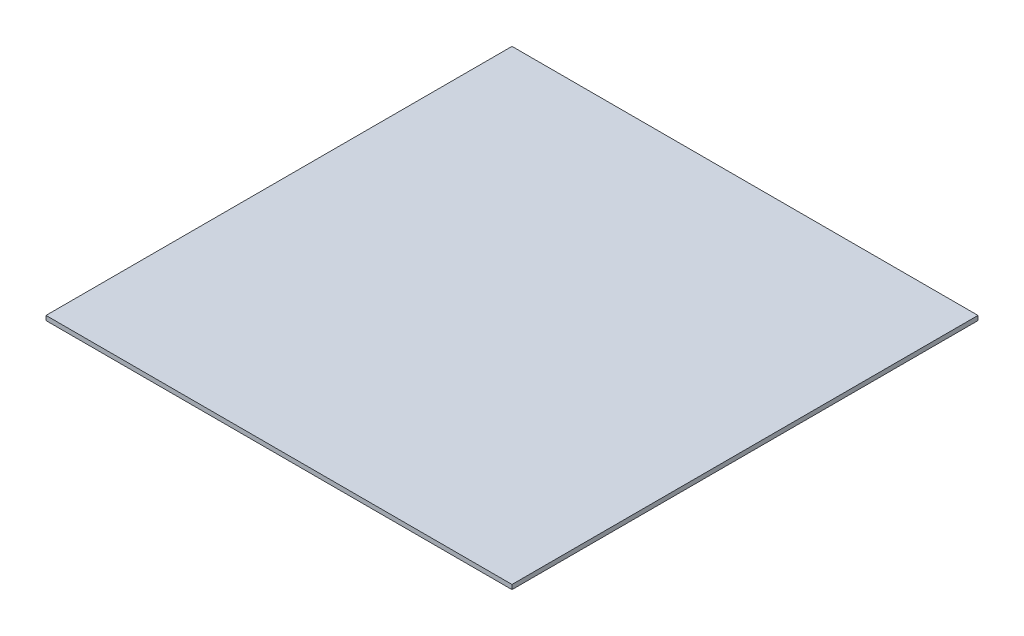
ISO-10303-21;
HEADER;
FILE_DESCRIPTION(('STEP AP214'),'2;1');
FILE_NAME('part.step','',(''),(''),'','','');
FILE_SCHEMA(('AUTOMOTIVE_DESIGN { 1 0 10303 214 1 1 1 1 }'));
ENDSEC;
DATA;
#1=APPLICATION_CONTEXT('core data for automotive mechanical design processes');
#2=APPLICATION_PROTOCOL_DEFINITION('international standard','automotive_design',2000,#1);
#3=PRODUCT_CONTEXT('',#1,'mechanical');
#4=PRODUCT('Part','Part','',(#3));
#5=PRODUCT_RELATED_PRODUCT_CATEGORY('part','',(#4));
#6=PRODUCT_DEFINITION_FORMATION('','',#4);
#7=PRODUCT_DEFINITION_CONTEXT('part definition',#1,'design');
#8=PRODUCT_DEFINITION('design','',#6,#7);
#9=PRODUCT_DEFINITION_SHAPE('','',#8);
#10=(LENGTH_UNIT() NAMED_UNIT(*) SI_UNIT(.MILLI.,.METRE.));
#11=(NAMED_UNIT(*) PLANE_ANGLE_UNIT() SI_UNIT($,.RADIAN.));
#12=(NAMED_UNIT(*) SI_UNIT($,.STERADIAN.) SOLID_ANGLE_UNIT());
#13=UNCERTAINTY_MEASURE_WITH_UNIT(LENGTH_MEASURE(1.E-05),#10,'distance_accuracy_value','');
#14=(GEOMETRIC_REPRESENTATION_CONTEXT(3) GLOBAL_UNCERTAINTY_ASSIGNED_CONTEXT((#13)) GLOBAL_UNIT_ASSIGNED_CONTEXT((#10,
#11,#12)) REPRESENTATION_CONTEXT('',''));
#15=CARTESIAN_POINT('',(0.,0.,0.));
#16=DIRECTION('',(0.,0.,1.));
#17=DIRECTION('',(1.,0.,0.));
#18=AXIS2_PLACEMENT_3D('',#15,#16,#17);
#19=CARTESIAN_POINT('',(155.,3.,155.));
#20=DIRECTION('',(-1.,0.,0.));
#21=DIRECTION('',(0.,0.,1.));
#22=AXIS2_PLACEMENT_3D('',#19,#20,#21);
#23=PLANE('',#22);
#24=DIRECTION('',(0.,0.,-1.));
#25=VECTOR('',#24,1.);
#26=CARTESIAN_POINT('',(155.,0.,155.));
#27=LINE('',#26,#25);
#28=CARTESIAN_POINT('',(155.,0.,155.));
#29=VERTEX_POINT('',#28);
#30=CARTESIAN_POINT('',(155.,0.,-155.));
#31=VERTEX_POINT('',#30);
#32=EDGE_CURVE('E114',#29,#31,#27,.T.);
#33=ORIENTED_EDGE('',*,*,#32,.T.);
#34=DIRECTION('',(0.,-1.,0.));
#35=VECTOR('',#34,1.);
#36=CARTESIAN_POINT('',(155.,3.,-155.));
#37=LINE('',#36,#35);
#38=CARTESIAN_POINT('',(155.,3.,-155.));
#39=VERTEX_POINT('',#38);
#40=EDGE_CURVE('E11',#39,#31,#37,.T.);
#41=ORIENTED_EDGE('',*,*,#40,.F.);
#42=DIRECTION('',(0.,0.,-1.));
#43=VECTOR('',#42,1.);
#44=CARTESIAN_POINT('',(155.,3.,155.));
#45=LINE('',#44,#43);
#46=CARTESIAN_POINT('',(155.,3.,155.));
#47=VERTEX_POINT('',#46);
#48=EDGE_CURVE('E98',#47,#39,#45,.T.);
#49=ORIENTED_EDGE('',*,*,#48,.F.);
#50=DIRECTION('',(0.,-1.,0.));
#51=VECTOR('',#50,1.);
#52=CARTESIAN_POINT('',(155.,3.,155.));
#53=LINE('',#52,#51);
#54=EDGE_CURVE('E110',#47,#29,#53,.T.);
#55=ORIENTED_EDGE('',*,*,#54,.T.);
#56=EDGE_LOOP('',(#33,#41,#49,#55));
#57=FACE_BOUND('',#56,.T.);
#58=ADVANCED_FACE('F42',(#57),#23,.F.);
#59=CARTESIAN_POINT('',(-155.,3.,-155.));
#60=DIRECTION('',(0.,0.,1.));
#61=DIRECTION('',(1.,0.,0.));
#62=AXIS2_PLACEMENT_3D('',#59,#60,#61);
#63=PLANE('',#62);
#64=DIRECTION('',(-1.,0.,0.));
#65=VECTOR('',#64,1.);
#66=CARTESIAN_POINT('',(-155.,0.,-155.));
#67=LINE('',#66,#65);
#68=CARTESIAN_POINT('',(-155.,0.,-155.));
#69=VERTEX_POINT('',#68);
#70=EDGE_CURVE('E103',#31,#69,#67,.T.);
#71=ORIENTED_EDGE('',*,*,#70,.T.);
#72=DIRECTION('',(0.,-1.,0.));
#73=VECTOR('',#72,1.);
#74=CARTESIAN_POINT('',(-155.,3.,-155.));
#75=LINE('',#74,#73);
#76=CARTESIAN_POINT('',(-155.,3.,-155.));
#77=VERTEX_POINT('',#76);
#78=EDGE_CURVE('E51',#77,#69,#75,.T.);
#79=ORIENTED_EDGE('',*,*,#78,.F.);
#80=DIRECTION('',(-1.,0.,0.));
#81=VECTOR('',#80,1.);
#82=CARTESIAN_POINT('',(-155.,3.,-155.));
#83=LINE('',#82,#81);
#84=EDGE_CURVE('E93',#39,#77,#83,.T.);
#85=ORIENTED_EDGE('',*,*,#84,.F.);
#86=ORIENTED_EDGE('',*,*,#40,.T.);
#87=EDGE_LOOP('',(#71,#79,#85,#86));
#88=FACE_BOUND('',#87,.T.);
#89=ADVANCED_FACE('F102',(#88),#63,.F.);
#90=CARTESIAN_POINT('',(-155.,3.,155.));
#91=DIRECTION('',(1.,0.,0.));
#92=DIRECTION('',(0.,0.,-1.));
#93=AXIS2_PLACEMENT_3D('',#90,#91,#92);
#94=PLANE('',#93);
#95=DIRECTION('',(0.,0.,1.));
#96=VECTOR('',#95,1.);
#97=CARTESIAN_POINT('',(-155.,0.,155.));
#98=LINE('',#97,#96);
#99=CARTESIAN_POINT('',(-155.,0.,155.));
#100=VERTEX_POINT('',#99);
#101=EDGE_CURVE('E79',#69,#100,#98,.T.);
#102=ORIENTED_EDGE('',*,*,#101,.T.);
#103=DIRECTION('',(0.,-1.,0.));
#104=VECTOR('',#103,1.);
#105=CARTESIAN_POINT('',(-155.,3.,155.));
#106=LINE('',#105,#104);
#107=CARTESIAN_POINT('',(-155.,3.,155.));
#108=VERTEX_POINT('',#107);
#109=EDGE_CURVE('E104',#108,#100,#106,.T.);
#110=ORIENTED_EDGE('',*,*,#109,.F.);
#111=DIRECTION('',(0.,0.,1.));
#112=VECTOR('',#111,1.);
#113=CARTESIAN_POINT('',(-155.,3.,155.));
#114=LINE('',#113,#112);
#115=EDGE_CURVE('E96',#77,#108,#114,.T.);
#116=ORIENTED_EDGE('',*,*,#115,.F.);
#117=ORIENTED_EDGE('',*,*,#78,.T.);
#118=EDGE_LOOP('',(#102,#110,#116,#117));
#119=FACE_BOUND('',#118,.T.);
#120=ADVANCED_FACE('F105',(#119),#94,.F.);
#121=CARTESIAN_POINT('',(-155.,3.,155.));
#122=DIRECTION('',(0.,0.,-1.));
#123=DIRECTION('',(-1.,0.,0.));
#124=AXIS2_PLACEMENT_3D('',#121,#122,#123);
#125=PLANE('',#124);
#126=DIRECTION('',(1.,0.,0.));
#127=VECTOR('',#126,1.);
#128=CARTESIAN_POINT('',(-155.,0.,155.));
#129=LINE('',#128,#127);
#130=EDGE_CURVE('E85',#100,#29,#129,.T.);
#131=ORIENTED_EDGE('',*,*,#130,.T.);
#132=ORIENTED_EDGE('',*,*,#54,.F.);
#133=DIRECTION('',(1.,0.,0.));
#134=VECTOR('',#133,1.);
#135=CARTESIAN_POINT('',(-155.,3.,155.));
#136=LINE('',#135,#134);
#137=EDGE_CURVE('E59',#108,#47,#136,.T.);
#138=ORIENTED_EDGE('',*,*,#137,.F.);
#139=ORIENTED_EDGE('',*,*,#109,.T.);
#140=EDGE_LOOP('',(#131,#132,#138,#139));
#141=FACE_BOUND('',#140,.T.);
#142=ADVANCED_FACE('F125',(#141),#125,.F.);
#143=CARTESIAN_POINT('',(0.,3.,0.));
#144=DIRECTION('',(0.,-1.,0.));
#145=DIRECTION('',(0.,0.,-1.));
#146=AXIS2_PLACEMENT_3D('',#143,#144,#145);
#147=PLANE('',#146);
#148=ORIENTED_EDGE('',*,*,#48,.T.);
#149=ORIENTED_EDGE('',*,*,#84,.T.);
#150=ORIENTED_EDGE('',*,*,#115,.T.);
#151=ORIENTED_EDGE('',*,*,#137,.T.);
#152=EDGE_LOOP('',(#148,#149,#150,#151));
#153=FACE_BOUND('',#152,.T.);
#154=ADVANCED_FACE('F94',(#153),#147,.F.);
#155=CARTESIAN_POINT('',(0.,0.,0.));
#156=DIRECTION('',(0.,-1.,0.));
#157=DIRECTION('',(0.,0.,-1.));
#158=AXIS2_PLACEMENT_3D('',#155,#156,#157);
#159=PLANE('',#158);
#160=ORIENTED_EDGE('',*,*,#32,.F.);
#161=ORIENTED_EDGE('',*,*,#130,.F.);
#162=ORIENTED_EDGE('',*,*,#101,.F.);
#163=ORIENTED_EDGE('',*,*,#70,.F.);
#164=EDGE_LOOP('',(#160,#161,#162,#163));
#165=FACE_BOUND('',#164,.T.);
#166=ADVANCED_FACE('F128',(#165),#159,.T.);
#167=CLOSED_SHELL('',(#58,#89,#120,#142,#154,#166));
#168=MANIFOLD_SOLID_BREP('B2',#167);
#169=ADVANCED_BREP_SHAPE_REPRESENTATION('',(#18,#168),#14);
#170=SHAPE_DEFINITION_REPRESENTATION(#9,#169);
ENDSEC;
END-ISO-10303-21;
